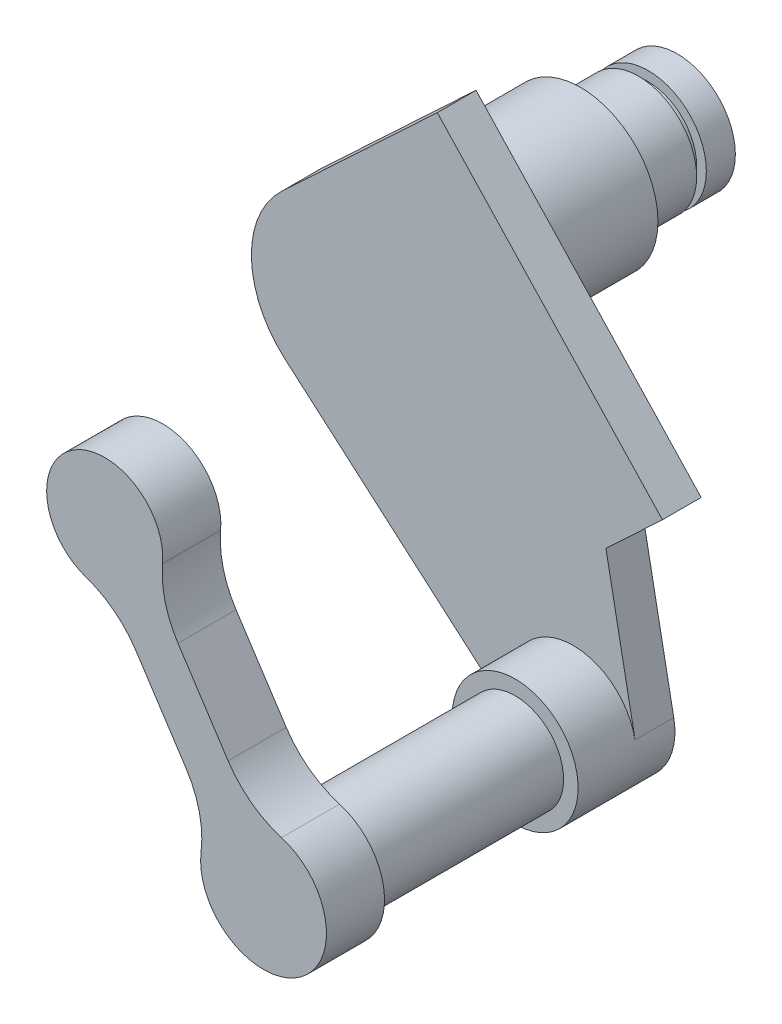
ISO-10303-21;
HEADER;
FILE_DESCRIPTION(('STEP AP214'),'2;1');
FILE_NAME('part.step','',(''),(''),'','','');
FILE_SCHEMA(('AUTOMOTIVE_DESIGN { 1 0 10303 214 1 1 1 1 }'));
ENDSEC;
DATA;
#1=APPLICATION_CONTEXT('core data for automotive mechanical design processes');
#2=APPLICATION_PROTOCOL_DEFINITION('international standard','automotive_design',2000,#1);
#3=PRODUCT_CONTEXT('',#1,'mechanical');
#4=PRODUCT('Part','Part','',(#3));
#5=PRODUCT_RELATED_PRODUCT_CATEGORY('part','',(#4));
#6=PRODUCT_DEFINITION_FORMATION('','',#4);
#7=PRODUCT_DEFINITION_CONTEXT('part definition',#1,'design');
#8=PRODUCT_DEFINITION('design','',#6,#7);
#9=PRODUCT_DEFINITION_SHAPE('','',#8);
#10=(LENGTH_UNIT() NAMED_UNIT(*) SI_UNIT(.MILLI.,.METRE.));
#11=(NAMED_UNIT(*) PLANE_ANGLE_UNIT() SI_UNIT($,.RADIAN.));
#12=(NAMED_UNIT(*) SI_UNIT($,.STERADIAN.) SOLID_ANGLE_UNIT());
#13=UNCERTAINTY_MEASURE_WITH_UNIT(LENGTH_MEASURE(1.E-05),#10,'distance_accuracy_value','');
#14=(GEOMETRIC_REPRESENTATION_CONTEXT(3) GLOBAL_UNCERTAINTY_ASSIGNED_CONTEXT((#13)) GLOBAL_UNIT_ASSIGNED_CONTEXT((#10,
#11,#12)) REPRESENTATION_CONTEXT('',''));
#15=CARTESIAN_POINT('',(0.,0.,0.));
#16=DIRECTION('',(0.,0.,1.));
#17=DIRECTION('',(1.,0.,0.));
#18=AXIS2_PLACEMENT_3D('',#15,#16,#17);
#19=CARTESIAN_POINT('',(-7.2469332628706,27.0459231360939,-15.));
#20=DIRECTION('',(0.,0.,-1.));
#21=DIRECTION('',(-1.,0.,0.));
#22=AXIS2_PLACEMENT_3D('',#19,#20,#21);
#23=PLANE('',#22);
#24=CARTESIAN_POINT('',(-7.2469332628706,27.0459231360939,-15.));
#25=DIRECTION('',(0.,0.,-1.));
#26=DIRECTION('',(-1.,0.,0.));
#27=AXIS2_PLACEMENT_3D('',#24,#25,#26);
#28=CIRCLE('',#27,3.25);
#29=CARTESIAN_POINT('',(-4.05542842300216,27.6597609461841,-15.));
#30=VERTEX_POINT('',#29);
#31=CARTESIAN_POINT('',(-9.37654934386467,24.5908802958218,-15.));
#32=VERTEX_POINT('',#31);
#33=EDGE_CURVE('E512',#30,#32,#28,.T.);
#34=ORIENTED_EDGE('',*,*,#33,.T.);
#35=DIRECTION('',(-0.755397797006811,0.655266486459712,0.));
#36=VECTOR('',#35,1.);
#37=CARTESIAN_POINT('',(-22.1500893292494,35.6712312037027,-15.));
#38=LINE('',#37,#36);
#39=CARTESIAN_POINT('',(-22.1500893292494,35.6712312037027,-15.));
#40=VERTEX_POINT('',#39);
#41=EDGE_CURVE('E515',#32,#40,#38,.T.);
#42=ORIENTED_EDGE('',*,*,#41,.T.);
#43=CARTESIAN_POINT('',(-18.8737568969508,39.4482201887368,-15.));
#44=DIRECTION('',(0.,0.,-1.));
#45=DIRECTION('',(-1.,0.,0.));
#46=AXIS2_PLACEMENT_3D('',#43,#44,#45);
#47=CIRCLE('',#46,5.);
#48=CARTESIAN_POINT('',(-22.2934109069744,43.0959546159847,-15.));
#49=VERTEX_POINT('',#48);
#50=EDGE_CURVE('E495',#40,#49,#47,.T.);
#51=ORIENTED_EDGE('',*,*,#50,.T.);
#52=DIRECTION('',(0.72954688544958,0.683930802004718,0.));
#53=VECTOR('',#52,1.);
#54=CARTESIAN_POINT('',(-14.268395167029,50.6191934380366,-15.));
#55=LINE('',#54,#53);
#56=CARTESIAN_POINT('',(-14.268395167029,50.6191934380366,-15.));
#57=VERTEX_POINT('',#56);
#58=EDGE_CURVE('E518',#49,#57,#55,.T.);
#59=ORIENTED_EDGE('',*,*,#58,.T.);
#60=DIRECTION('',(0.683930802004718,-0.72954688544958,0.));
#61=VECTOR('',#60,1.);
#62=CARTESIAN_POINT('',(-14.268395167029,50.6191934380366,-15.));
#63=LINE('',#62,#61);
#64=CARTESIAN_POINT('',(-2.64157153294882,38.2168963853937,-15.));
#65=VERTEX_POINT('',#64);
#66=EDGE_CURVE('E520',#57,#65,#63,.T.);
#67=ORIENTED_EDGE('',*,*,#66,.T.);
#68=DIRECTION('',(-0.729546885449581,-0.683930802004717,0.));
#69=VECTOR('',#68,1.);
#70=CARTESIAN_POINT('',(-2.64157153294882,38.2168963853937,-15.));
#71=LINE('',#70,#69);
#72=CARTESIAN_POINT('',(-5.55975907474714,35.4811731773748,-15.));
#73=VERTEX_POINT('',#72);
#74=EDGE_CURVE('E522',#65,#73,#71,.T.);
#75=ORIENTED_EDGE('',*,*,#74,.T.);
#76=DIRECTION('',(0.188873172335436,-0.982001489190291,0.));
#77=VECTOR('',#76,1.);
#78=CARTESIAN_POINT('',(-5.55975907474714,35.4811731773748,-15.));
#79=LINE('',#78,#77);
#80=EDGE_CURVE('E524',#73,#30,#79,.T.);
#81=ORIENTED_EDGE('',*,*,#80,.T.);
#82=EDGE_LOOP('',(#34,#42,#51,#59,#67,#75,#81));
#83=FACE_BOUND('',#82,.T.);
#84=CARTESIAN_POINT('',(-18.8737568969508,39.4482201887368,-15.));
#85=DIRECTION('',(0.,0.,1.));
#86=DIRECTION('',(1.,0.,0.));
#87=AXIS2_PLACEMENT_3D('',#84,#85,#86);
#88=CIRCLE('',#87,4.);
#89=CARTESIAN_POINT('',(-14.8737568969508,39.4482201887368,-15.));
#90=VERTEX_POINT('',#89);
#91=EDGE_CURVE('E637',#90,#90,#88,.T.);
#92=ORIENTED_EDGE('',*,*,#91,.T.);
#93=EDGE_LOOP('',(#92));
#94=FACE_BOUND('',#93,.T.);
#95=ADVANCED_FACE('F369',(#83,#94),#23,.T.);
#96=CARTESIAN_POINT('',(-7.47931043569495,38.9174814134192,0.));
#97=DIRECTION('',(0.,0.,-1.));
#98=DIRECTION('',(-1.,0.,0.));
#99=AXIS2_PLACEMENT_3D('',#96,#97,#98);
#100=PLANE('',#99);
#101=CARTESIAN_POINT('',(-7.47931043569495,38.9174814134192,0.));
#102=DIRECTION('',(0.,0.,-1.));
#103=DIRECTION('',(-1.,0.,0.));
#104=AXIS2_PLACEMENT_3D('',#101,#102,#103);
#105=CIRCLE('',#104,5.);
#106=CARTESIAN_POINT('',(-11.6654442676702,36.1832020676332,0.));
#107=VERTEX_POINT('',#106);
#108=CARTESIAN_POINT('',(-12.4608484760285,39.3467584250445,0.));
#109=VERTEX_POINT('',#108);
#110=EDGE_CURVE('E546',#107,#109,#105,.T.);
#111=ORIENTED_EDGE('',*,*,#110,.F.);
#112=DIRECTION('',(-0.5468558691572,0.837226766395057,0.));
#113=VECTOR('',#112,1.);
#114=CARTESIAN_POINT('',(-11.6654442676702,36.1832020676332,0.));
#115=LINE('',#114,#113);
#116=CARTESIAN_POINT('',(-9.07515286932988,32.2175112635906,0.));
#117=VERTEX_POINT('',#116);
#118=EDGE_CURVE('E561',#117,#107,#115,.T.);
#119=ORIENTED_EDGE('',*,*,#118,.F.);
#120=CARTESIAN_POINT('',(-4.88901903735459,34.9517906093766,0.));
#121=DIRECTION('',(0.,0.,-1.));
#122=DIRECTION('',(1.,0.,0.));
#123=AXIS2_PLACEMENT_3D('',#120,#121,#122);
#124=CIRCLE('',#123,5.);
#125=CARTESIAN_POINT('',(-6.31805796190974,30.160355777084,0.));
#126=VERTEX_POINT('',#125);
#127=EDGE_CURVE('E559',#126,#117,#124,.T.);
#128=ORIENTED_EDGE('',*,*,#127,.F.);
#129=CARTESIAN_POINT('',(-7.2469332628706,27.0459231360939,0.));
#130=DIRECTION('',(0.,0.,1.));
#131=DIRECTION('',(1.,0.,0.));
#132=AXIS2_PLACEMENT_3D('',#129,#130,#131);
#133=CIRCLE('',#132,3.25);
#134=CARTESIAN_POINT('',(-10.4720842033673,27.4470483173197,0.));
#135=VERTEX_POINT('',#134);
#136=EDGE_CURVE('E557',#135,#126,#133,.T.);
#137=ORIENTED_EDGE('',*,*,#136,.F.);
#138=CARTESIAN_POINT('',(-15.4338548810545,28.0641639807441,0.));
#139=DIRECTION('',(0.,0.,-1.));
#140=DIRECTION('',(1.,0.,0.));
#141=AXIS2_PLACEMENT_3D('',#138,#139,#140);
#142=CIRCLE('',#141,5.);
#143=CARTESIAN_POINT('',(-11.2477210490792,30.7984433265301,0.));
#144=VERTEX_POINT('',#143);
#145=EDGE_CURVE('E555',#144,#135,#142,.T.);
#146=ORIENTED_EDGE('',*,*,#145,.F.);
#147=DIRECTION('',(0.5468558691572,-0.837226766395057,0.));
#148=VECTOR('',#147,1.);
#149=CARTESIAN_POINT('',(-13.8380124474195,34.7641341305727,0.));
#150=LINE('',#149,#148);
#151=CARTESIAN_POINT('',(-13.8380124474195,34.7641341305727,0.));
#152=VERTEX_POINT('',#151);
#153=EDGE_CURVE('E553',#152,#144,#150,.T.);
#154=ORIENTED_EDGE('',*,*,#153,.F.);
#155=CARTESIAN_POINT('',(-18.0241462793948,32.0298547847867,0.));
#156=DIRECTION('',(0.,0.,-1.));
#157=DIRECTION('',(1.,0.,0.));
#158=AXIS2_PLACEMENT_3D('',#155,#156,#157);
#159=CIRCLE('',#158,5.);
#160=CARTESIAN_POINT('',(-16.4151619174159,36.7638984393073,0.));
#161=VERTEX_POINT('',#160);
#162=EDGE_CURVE('E551',#161,#152,#159,.T.);
#163=ORIENTED_EDGE('',*,*,#162,.F.);
#164=CARTESIAN_POINT('',(-15.4497713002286,39.6043246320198,0.));
#165=DIRECTION('',(0.,0.,1.));
#166=DIRECTION('',(1.,0.,0.));
#167=AXIS2_PLACEMENT_3D('',#164,#165,#166);
#168=CIRCLE('',#167,3.);
#169=EDGE_CURVE('E549',#109,#161,#168,.T.);
#170=ORIENTED_EDGE('',*,*,#169,.F.);
#171=EDGE_LOOP('',(#111,#119,#128,#137,#146,#154,#163,#170));
#172=FACE_BOUND('',#171,.T.);
#173=CARTESIAN_POINT('',(-7.2469332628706,27.0459231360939,0.));
#174=DIRECTION('',(0.,0.,-1.));
#175=DIRECTION('',(-1.,0.,0.));
#176=AXIS2_PLACEMENT_3D('',#173,#174,#175);
#177=CIRCLE('',#176,2.5);
#178=CARTESIAN_POINT('',(-4.7469332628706,27.0459231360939,0.));
#179=VERTEX_POINT('',#178);
#180=EDGE_CURVE('E540',#179,#179,#177,.T.);
#181=ORIENTED_EDGE('',*,*,#180,.F.);
#182=EDGE_LOOP('',(#181));
#183=FACE_BOUND('',#182,.T.);
#184=ADVANCED_FACE('F633',(#172,#183),#100,.T.);
#185=CARTESIAN_POINT('',(-7.47931043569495,38.9174814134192,3.));
#186=DIRECTION('',(0.,0.,-1.));
#187=DIRECTION('',(-1.,0.,0.));
#188=AXIS2_PLACEMENT_3D('',#185,#186,#187);
#189=CYLINDRICAL_SURFACE('',#188,5.);
#190=ORIENTED_EDGE('',*,*,#110,.T.);
#191=DIRECTION('',(0.,0.,-1.));
#192=VECTOR('',#191,1.);
#193=CARTESIAN_POINT('',(-12.4608484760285,39.3467584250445,3.));
#194=LINE('',#193,#192);
#195=CARTESIAN_POINT('',(-12.4608484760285,39.3467584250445,3.));
#196=VERTEX_POINT('',#195);
#197=EDGE_CURVE('E11',#196,#109,#194,.T.);
#198=ORIENTED_EDGE('',*,*,#197,.F.);
#199=CARTESIAN_POINT('',(-7.47931043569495,38.9174814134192,3.));
#200=DIRECTION('',(0.,0.,-1.));
#201=DIRECTION('',(-1.,0.,0.));
#202=AXIS2_PLACEMENT_3D('',#199,#200,#201);
#203=CIRCLE('',#202,5.);
#204=CARTESIAN_POINT('',(-11.6654442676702,36.1832020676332,3.));
#205=VERTEX_POINT('',#204);
#206=EDGE_CURVE('E563',#205,#196,#203,.T.);
#207=ORIENTED_EDGE('',*,*,#206,.F.);
#208=DIRECTION('',(0.,0.,-1.));
#209=VECTOR('',#208,1.);
#210=CARTESIAN_POINT('',(-11.6654442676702,36.1832020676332,3.));
#211=LINE('',#210,#209);
#212=EDGE_CURVE('E578',#205,#107,#211,.T.);
#213=ORIENTED_EDGE('',*,*,#212,.T.);
#214=EDGE_LOOP('',(#190,#198,#207,#213));
#215=FACE_BOUND('',#214,.T.);
#216=ADVANCED_FACE('F371',(#215),#189,.F.);
#217=CARTESIAN_POINT('',(-15.4497713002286,39.6043246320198,3.));
#218=DIRECTION('',(0.,0.,-1.));
#219=DIRECTION('',(-1.,0.,0.));
#220=AXIS2_PLACEMENT_3D('',#217,#218,#219);
#221=CYLINDRICAL_SURFACE('',#220,3.);
#222=ORIENTED_EDGE('',*,*,#169,.T.);
#223=DIRECTION('',(0.,0.,-1.));
#224=VECTOR('',#223,1.);
#225=CARTESIAN_POINT('',(-16.4151619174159,36.7638984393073,3.));
#226=LINE('',#225,#224);
#227=CARTESIAN_POINT('',(-16.4151619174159,36.7638984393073,3.));
#228=VERTEX_POINT('',#227);
#229=EDGE_CURVE('E378',#228,#161,#226,.T.);
#230=ORIENTED_EDGE('',*,*,#229,.F.);
#231=CARTESIAN_POINT('',(-15.4497713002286,39.6043246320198,3.));
#232=DIRECTION('',(0.,0.,1.));
#233=DIRECTION('',(1.,0.,0.));
#234=AXIS2_PLACEMENT_3D('',#231,#232,#233);
#235=CIRCLE('',#234,3.);
#236=EDGE_CURVE('E565',#196,#228,#235,.T.);
#237=ORIENTED_EDGE('',*,*,#236,.F.);
#238=ORIENTED_EDGE('',*,*,#197,.T.);
#239=EDGE_LOOP('',(#222,#230,#237,#238));
#240=FACE_BOUND('',#239,.T.);
#241=ADVANCED_FACE('F727',(#240),#221,.T.);
#242=CARTESIAN_POINT('',(-18.0241462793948,32.0298547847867,3.));
#243=DIRECTION('',(0.,0.,-1.));
#244=DIRECTION('',(-1.,0.,0.));
#245=AXIS2_PLACEMENT_3D('',#242,#243,#244);
#246=CYLINDRICAL_SURFACE('',#245,5.);
#247=ORIENTED_EDGE('',*,*,#162,.T.);
#248=DIRECTION('',(0.,0.,-1.));
#249=VECTOR('',#248,1.);
#250=CARTESIAN_POINT('',(-13.8380124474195,34.7641341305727,3.));
#251=LINE('',#250,#249);
#252=CARTESIAN_POINT('',(-13.8380124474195,34.7641341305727,3.));
#253=VERTEX_POINT('',#252);
#254=EDGE_CURVE('E593',#253,#152,#251,.T.);
#255=ORIENTED_EDGE('',*,*,#254,.F.);
#256=CARTESIAN_POINT('',(-18.0241462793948,32.0298547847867,3.));
#257=DIRECTION('',(0.,0.,-1.));
#258=DIRECTION('',(1.,0.,0.));
#259=AXIS2_PLACEMENT_3D('',#256,#257,#258);
#260=CIRCLE('',#259,5.);
#261=EDGE_CURVE('E567',#228,#253,#260,.T.);
#262=ORIENTED_EDGE('',*,*,#261,.F.);
#263=ORIENTED_EDGE('',*,*,#229,.T.);
#264=EDGE_LOOP('',(#247,#255,#262,#263));
#265=FACE_BOUND('',#264,.T.);
#266=ADVANCED_FACE('F724',(#265),#246,.F.);
#267=CARTESIAN_POINT('',(-13.8380124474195,34.7641341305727,3.));
#268=DIRECTION('',(0.837226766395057,0.5468558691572,0.));
#269=DIRECTION('',(-0.546855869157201,0.837226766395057,0.));
#270=AXIS2_PLACEMENT_3D('',#267,#268,#269);
#271=PLANE('',#270);
#272=ORIENTED_EDGE('',*,*,#153,.T.);
#273=DIRECTION('',(0.,0.,-1.));
#274=VECTOR('',#273,1.);
#275=CARTESIAN_POINT('',(-11.2477210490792,30.7984433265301,3.));
#276=LINE('',#275,#274);
#277=CARTESIAN_POINT('',(-11.2477210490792,30.7984433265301,3.));
#278=VERTEX_POINT('',#277);
#279=EDGE_CURVE('E590',#278,#144,#276,.T.);
#280=ORIENTED_EDGE('',*,*,#279,.F.);
#281=DIRECTION('',(0.5468558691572,-0.837226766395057,0.));
#282=VECTOR('',#281,1.);
#283=CARTESIAN_POINT('',(-13.8380124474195,34.7641341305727,3.));
#284=LINE('',#283,#282);
#285=EDGE_CURVE('E569',#253,#278,#284,.T.);
#286=ORIENTED_EDGE('',*,*,#285,.F.);
#287=ORIENTED_EDGE('',*,*,#254,.T.);
#288=EDGE_LOOP('',(#272,#280,#286,#287));
#289=FACE_BOUND('',#288,.T.);
#290=ADVANCED_FACE('F720',(#289),#271,.F.);
#291=CARTESIAN_POINT('',(-15.4338548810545,28.0641639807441,3.));
#292=DIRECTION('',(0.,0.,-1.));
#293=DIRECTION('',(-1.,0.,0.));
#294=AXIS2_PLACEMENT_3D('',#291,#292,#293);
#295=CYLINDRICAL_SURFACE('',#294,5.);
#296=ORIENTED_EDGE('',*,*,#145,.T.);
#297=DIRECTION('',(0.,0.,-1.));
#298=VECTOR('',#297,1.);
#299=CARTESIAN_POINT('',(-10.4720842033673,27.4470483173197,3.));
#300=LINE('',#299,#298);
#301=CARTESIAN_POINT('',(-10.4720842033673,27.4470483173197,3.));
#302=VERTEX_POINT('',#301);
#303=EDGE_CURVE('E587',#302,#135,#300,.T.);
#304=ORIENTED_EDGE('',*,*,#303,.F.);
#305=CARTESIAN_POINT('',(-15.4338548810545,28.0641639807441,3.));
#306=DIRECTION('',(0.,0.,-1.));
#307=DIRECTION('',(1.,0.,0.));
#308=AXIS2_PLACEMENT_3D('',#305,#306,#307);
#309=CIRCLE('',#308,5.);
#310=EDGE_CURVE('E571',#278,#302,#309,.T.);
#311=ORIENTED_EDGE('',*,*,#310,.F.);
#312=ORIENTED_EDGE('',*,*,#279,.T.);
#313=EDGE_LOOP('',(#296,#304,#311,#312));
#314=FACE_BOUND('',#313,.T.);
#315=ADVANCED_FACE('F716',(#314),#295,.F.);
#316=CARTESIAN_POINT('',(-7.2469332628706,27.0459231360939,3.));
#317=DIRECTION('',(0.,0.,-1.));
#318=DIRECTION('',(-1.,0.,0.));
#319=AXIS2_PLACEMENT_3D('',#316,#317,#318);
#320=CYLINDRICAL_SURFACE('',#319,3.25);
#321=ORIENTED_EDGE('',*,*,#136,.T.);
#322=DIRECTION('',(0.,0.,-1.));
#323=VECTOR('',#322,1.);
#324=CARTESIAN_POINT('',(-6.31805796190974,30.160355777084,3.));
#325=LINE('',#324,#323);
#326=CARTESIAN_POINT('',(-6.31805796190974,30.160355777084,3.));
#327=VERTEX_POINT('',#326);
#328=EDGE_CURVE('E584',#327,#126,#325,.T.);
#329=ORIENTED_EDGE('',*,*,#328,.F.);
#330=CARTESIAN_POINT('',(-7.2469332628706,27.0459231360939,3.));
#331=DIRECTION('',(0.,0.,1.));
#332=DIRECTION('',(1.,0.,0.));
#333=AXIS2_PLACEMENT_3D('',#330,#331,#332);
#334=CIRCLE('',#333,3.25);
#335=EDGE_CURVE('E573',#302,#327,#334,.T.);
#336=ORIENTED_EDGE('',*,*,#335,.F.);
#337=ORIENTED_EDGE('',*,*,#303,.T.);
#338=EDGE_LOOP('',(#321,#329,#336,#337));
#339=FACE_BOUND('',#338,.T.);
#340=ADVANCED_FACE('F712',(#339),#320,.T.);
#341=CARTESIAN_POINT('',(-4.88901903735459,34.9517906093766,3.));
#342=DIRECTION('',(0.,0.,-1.));
#343=DIRECTION('',(-1.,0.,0.));
#344=AXIS2_PLACEMENT_3D('',#341,#342,#343);
#345=CYLINDRICAL_SURFACE('',#344,5.);
#346=ORIENTED_EDGE('',*,*,#127,.T.);
#347=DIRECTION('',(0.,0.,-1.));
#348=VECTOR('',#347,1.);
#349=CARTESIAN_POINT('',(-9.07515286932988,32.2175112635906,3.));
#350=LINE('',#349,#348);
#351=CARTESIAN_POINT('',(-9.07515286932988,32.2175112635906,3.));
#352=VERTEX_POINT('',#351);
#353=EDGE_CURVE('E581',#352,#117,#350,.T.);
#354=ORIENTED_EDGE('',*,*,#353,.F.);
#355=CARTESIAN_POINT('',(-4.88901903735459,34.9517906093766,3.));
#356=DIRECTION('',(0.,0.,-1.));
#357=DIRECTION('',(1.,0.,0.));
#358=AXIS2_PLACEMENT_3D('',#355,#356,#357);
#359=CIRCLE('',#358,5.);
#360=EDGE_CURVE('E575',#327,#352,#359,.T.);
#361=ORIENTED_EDGE('',*,*,#360,.F.);
#362=ORIENTED_EDGE('',*,*,#328,.T.);
#363=EDGE_LOOP('',(#346,#354,#361,#362));
#364=FACE_BOUND('',#363,.T.);
#365=ADVANCED_FACE('F708',(#364),#345,.F.);
#366=CARTESIAN_POINT('',(-11.6654442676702,36.1832020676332,3.));
#367=DIRECTION('',(-0.837226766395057,-0.5468558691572,0.));
#368=DIRECTION('',(0.5468558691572,-0.837226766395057,0.));
#369=AXIS2_PLACEMENT_3D('',#366,#367,#368);
#370=PLANE('',#369);
#371=ORIENTED_EDGE('',*,*,#118,.T.);
#372=ORIENTED_EDGE('',*,*,#212,.F.);
#373=DIRECTION('',(-0.5468558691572,0.837226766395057,0.));
#374=VECTOR('',#373,1.);
#375=CARTESIAN_POINT('',(-11.6654442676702,36.1832020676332,3.));
#376=LINE('',#375,#374);
#377=EDGE_CURVE('E394',#352,#205,#376,.T.);
#378=ORIENTED_EDGE('',*,*,#377,.F.);
#379=ORIENTED_EDGE('',*,*,#353,.T.);
#380=EDGE_LOOP('',(#371,#372,#378,#379));
#381=FACE_BOUND('',#380,.T.);
#382=ADVANCED_FACE('F705',(#381),#370,.F.);
#383=CARTESIAN_POINT('',(-7.47931043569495,38.9174814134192,3.));
#384=DIRECTION('',(0.,0.,-1.));
#385=DIRECTION('',(-1.,0.,0.));
#386=AXIS2_PLACEMENT_3D('',#383,#384,#385);
#387=PLANE('',#386);
#388=ORIENTED_EDGE('',*,*,#206,.T.);
#389=ORIENTED_EDGE('',*,*,#236,.T.);
#390=ORIENTED_EDGE('',*,*,#261,.T.);
#391=ORIENTED_EDGE('',*,*,#285,.T.);
#392=ORIENTED_EDGE('',*,*,#310,.T.);
#393=ORIENTED_EDGE('',*,*,#335,.T.);
#394=ORIENTED_EDGE('',*,*,#360,.T.);
#395=ORIENTED_EDGE('',*,*,#377,.T.);
#396=EDGE_LOOP('',(#388,#389,#390,#391,#392,#393,#394,#395));
#397=FACE_BOUND('',#396,.T.);
#398=ADVANCED_FACE('F698',(#397),#387,.F.);
#399=CARTESIAN_POINT('',(-7.2469332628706,27.0459231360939,-17.0710678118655));
#400=DIRECTION('',(0.,0.,1.));
#401=DIRECTION('',(1.,0.,0.));
#402=AXIS2_PLACEMENT_3D('',#399,#400,#401);
#403=CYLINDRICAL_SURFACE('',#402,2.5);
#404=CARTESIAN_POINT('',(-7.2469332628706,27.0459231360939,-10.));
#405=DIRECTION('',(0.,0.,-1.));
#406=DIRECTION('',(-1.,0.,0.));
#407=AXIS2_PLACEMENT_3D('',#404,#405,#406);
#408=CIRCLE('',#407,2.5);
#409=CARTESIAN_POINT('',(-4.7469332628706,27.0459231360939,-10.));
#410=VERTEX_POINT('',#409);
#411=EDGE_CURVE('E543',#410,#410,#408,.T.);
#412=CARTESIAN_POINT('',(-4.7469332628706,27.0459231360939,0.));
#413=CARTESIAN_POINT('',(-4.7469332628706,27.0459231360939,-0.104166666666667));
#414=CARTESIAN_POINT('',(-4.7469332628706,27.0459231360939,-0.208333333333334));
#415=CARTESIAN_POINT('',(-4.7469332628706,27.0459231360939,-0.416666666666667));
#416=CARTESIAN_POINT('',(-4.7469332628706,27.0459231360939,-0.520833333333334));
#417=CARTESIAN_POINT('',(-4.7469332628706,27.0459231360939,-0.729166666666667));
#418=CARTESIAN_POINT('',(-4.7469332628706,27.0459231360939,-0.833333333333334));
#419=CARTESIAN_POINT('',(-4.7469332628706,27.0459231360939,-1.04166666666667));
#420=CARTESIAN_POINT('',(-4.7469332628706,27.0459231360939,-1.14583333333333));
#421=CARTESIAN_POINT('',(-4.7469332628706,27.0459231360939,-1.35416666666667));
#422=CARTESIAN_POINT('',(-4.7469332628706,27.0459231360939,-1.45833333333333));
#423=CARTESIAN_POINT('',(-4.7469332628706,27.0459231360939,-1.66666666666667));
#424=CARTESIAN_POINT('',(-4.7469332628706,27.0459231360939,-1.77083333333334));
#425=CARTESIAN_POINT('',(-4.7469332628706,27.0459231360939,-1.97916666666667));
#426=CARTESIAN_POINT('',(-4.7469332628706,27.0459231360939,-2.08333333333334));
#427=CARTESIAN_POINT('',(-4.7469332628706,27.0459231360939,-2.29166666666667));
#428=CARTESIAN_POINT('',(-4.7469332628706,27.0459231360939,-2.39583333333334));
#429=CARTESIAN_POINT('',(-4.7469332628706,27.0459231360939,-2.60416666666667));
#430=CARTESIAN_POINT('',(-4.7469332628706,27.0459231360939,-2.70833333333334));
#431=CARTESIAN_POINT('',(-4.7469332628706,27.0459231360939,-2.91666666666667));
#432=CARTESIAN_POINT('',(-4.7469332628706,27.0459231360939,-3.02083333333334));
#433=CARTESIAN_POINT('',(-4.7469332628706,27.0459231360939,-3.22916666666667));
#434=CARTESIAN_POINT('',(-4.7469332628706,27.0459231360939,-3.33333333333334));
#435=CARTESIAN_POINT('',(-4.7469332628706,27.0459231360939,-3.54166666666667));
#436=CARTESIAN_POINT('',(-4.7469332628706,27.0459231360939,-3.64583333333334));
#437=CARTESIAN_POINT('',(-4.7469332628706,27.0459231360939,-3.85416666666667));
#438=CARTESIAN_POINT('',(-4.7469332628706,27.0459231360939,-3.95833333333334));
#439=CARTESIAN_POINT('',(-4.7469332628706,27.0459231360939,-4.16666666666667));
#440=CARTESIAN_POINT('',(-4.7469332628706,27.0459231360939,-4.27083333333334));
#441=CARTESIAN_POINT('',(-4.7469332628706,27.0459231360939,-4.47916666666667));
#442=CARTESIAN_POINT('',(-4.7469332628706,27.0459231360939,-4.58333333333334));
#443=CARTESIAN_POINT('',(-4.7469332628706,27.0459231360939,-4.79166666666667));
#444=CARTESIAN_POINT('',(-4.7469332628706,27.0459231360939,-4.89583333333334));
#445=CARTESIAN_POINT('',(-4.7469332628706,27.0459231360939,-5.10416666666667));
#446=CARTESIAN_POINT('',(-4.7469332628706,27.0459231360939,-5.20833333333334));
#447=CARTESIAN_POINT('',(-4.7469332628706,27.0459231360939,-5.41666666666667));
#448=CARTESIAN_POINT('',(-4.7469332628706,27.0459231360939,-5.52083333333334));
#449=CARTESIAN_POINT('',(-4.7469332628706,27.0459231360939,-5.72916666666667));
#450=CARTESIAN_POINT('',(-4.7469332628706,27.0459231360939,-5.83333333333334));
#451=CARTESIAN_POINT('',(-4.7469332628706,27.0459231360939,-6.04166666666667));
#452=CARTESIAN_POINT('',(-4.7469332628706,27.0459231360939,-6.14583333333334));
#453=CARTESIAN_POINT('',(-4.7469332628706,27.0459231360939,-6.35416666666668));
#454=CARTESIAN_POINT('',(-4.7469332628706,27.0459231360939,-6.45833333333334));
#455=CARTESIAN_POINT('',(-4.7469332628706,27.0459231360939,-6.66666666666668));
#456=CARTESIAN_POINT('',(-4.7469332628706,27.0459231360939,-6.77083333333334));
#457=CARTESIAN_POINT('',(-4.7469332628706,27.0459231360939,-6.97916666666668));
#458=CARTESIAN_POINT('',(-4.7469332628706,27.0459231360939,-7.08333333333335));
#459=CARTESIAN_POINT('',(-4.7469332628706,27.0459231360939,-7.29166666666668));
#460=CARTESIAN_POINT('',(-4.7469332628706,27.0459231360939,-7.39583333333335));
#461=CARTESIAN_POINT('',(-4.7469332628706,27.0459231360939,-7.60416666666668));
#462=CARTESIAN_POINT('',(-4.7469332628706,27.0459231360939,-7.70833333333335));
#463=CARTESIAN_POINT('',(-4.7469332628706,27.0459231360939,-7.91666666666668));
#464=CARTESIAN_POINT('',(-4.7469332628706,27.0459231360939,-8.02083333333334));
#465=CARTESIAN_POINT('',(-4.7469332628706,27.0459231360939,-8.22916666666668));
#466=CARTESIAN_POINT('',(-4.7469332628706,27.0459231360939,-8.33333333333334));
#467=CARTESIAN_POINT('',(-4.7469332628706,27.0459231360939,-8.54166666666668));
#468=CARTESIAN_POINT('',(-4.7469332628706,27.0459231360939,-8.64583333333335));
#469=CARTESIAN_POINT('',(-4.7469332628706,27.0459231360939,-8.85416666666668));
#470=CARTESIAN_POINT('',(-4.7469332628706,27.0459231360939,-8.95833333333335));
#471=CARTESIAN_POINT('',(-4.7469332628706,27.0459231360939,-9.16666666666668));
#472=CARTESIAN_POINT('',(-4.7469332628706,27.0459231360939,-9.27083333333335));
#473=CARTESIAN_POINT('',(-4.7469332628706,27.0459231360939,-9.47916666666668));
#474=CARTESIAN_POINT('',(-4.7469332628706,27.0459231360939,-9.58333333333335));
#475=CARTESIAN_POINT('',(-4.7469332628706,27.0459231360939,-9.79166666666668));
#476=CARTESIAN_POINT('',(-4.7469332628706,27.0459231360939,-9.89583333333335));
#477=CARTESIAN_POINT('',(-4.7469332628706,27.0459231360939,-10.));
#478=B_SPLINE_CURVE_WITH_KNOTS('',3,(#412,#413,#414,#415,#416,#417,#418,#419,#420,#421,#422,
#423,#424,#425,#426,#427,#428,#429,#430,#431,#432,#433,#434,#435,#436,#437,#438,#439,#440,#441,
#442,#443,#444,#445,#446,#447,#448,#449,#450,#451,#452,#453,#454,#455,#456,#457,#458,#459,#460,
#461,#462,#463,#464,#465,#466,#467,#468,#469,#470,#471,#472,#473,#474,#475,#476,#477),
.UNSPECIFIED.,.F.,.F.,(4,2,2,2,2,2,2,2,2,2,2,2,2,2,2,2,2,2,2,2,2,2,2,2,2,2,2,2,2,2,2,2,4),(0.,
0.3125,0.625000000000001,0.937500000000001,1.25,1.5625,1.875,2.1875,2.5,2.8125,3.125,3.4375,
3.75,4.06250000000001,4.37500000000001,4.68750000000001,5.00000000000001,5.31250000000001,
5.62500000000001,5.93750000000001,6.25000000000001,6.56250000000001,6.87500000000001,
7.18750000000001,7.50000000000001,7.81250000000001,8.12500000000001,8.43750000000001,
8.75000000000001,9.06250000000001,9.37500000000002,9.68750000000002,10.),.UNSPECIFIED.);
#479=EDGE_CURVE('BSEAM692',#179,#410,#478,.T.);
#480=ORIENTED_EDGE('',*,*,#180,.T.);
#481=ORIENTED_EDGE('',*,*,#411,.F.);
#482=ORIENTED_EDGE('',*,*,#479,.T.);
#483=ORIENTED_EDGE('',*,*,#479,.F.);
#484=EDGE_LOOP('',(#480,#482,#481,#483));
#485=FACE_BOUND('',#484,.T.);
#486=ADVANCED_FACE('F692',(#485),#403,.T.);
#487=CARTESIAN_POINT('',(-7.2469332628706,27.0459231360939,-10.));
#488=DIRECTION('',(0.,0.,-1.));
#489=DIRECTION('',(-1.,0.,0.));
#490=AXIS2_PLACEMENT_3D('',#487,#488,#489);
#491=PLANE('',#490);
#492=CARTESIAN_POINT('',(-7.2469332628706,27.0459231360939,-10.));
#493=DIRECTION('',(0.,0.,-1.));
#494=DIRECTION('',(-1.,0.,0.));
#495=AXIS2_PLACEMENT_3D('',#492,#493,#494);
#496=CIRCLE('',#495,3.25);
#497=CARTESIAN_POINT('',(-10.4969332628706,27.0459231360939,-10.));
#498=VERTEX_POINT('',#497);
#499=EDGE_CURVE('E537',#498,#498,#496,.T.);
#500=ORIENTED_EDGE('',*,*,#499,.F.);
#501=EDGE_LOOP('',(#500));
#502=FACE_BOUND('',#501,.T.);
#503=ORIENTED_EDGE('',*,*,#411,.T.);
#504=EDGE_LOOP('',(#503));
#505=FACE_BOUND('',#504,.T.);
#506=ADVANCED_FACE('F689',(#502,#505),#491,.F.);
#507=CARTESIAN_POINT('',(-7.2469332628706,27.0459231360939,-13.));
#508=DIRECTION('',(0.,0.,1.));
#509=DIRECTION('',(1.,0.,0.));
#510=AXIS2_PLACEMENT_3D('',#507,#508,#509);
#511=CYLINDRICAL_SURFACE('',#510,3.25);
#512=CARTESIAN_POINT('',(-7.2469332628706,27.0459231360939,-13.));
#513=DIRECTION('',(0.,0.,-1.));
#514=DIRECTION('',(-1.,0.,0.));
#515=AXIS2_PLACEMENT_3D('',#512,#513,#514);
#516=CIRCLE('',#515,3.25);
#517=CARTESIAN_POINT('',(-9.37654934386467,24.5908802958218,-13.));
#518=VERTEX_POINT('',#517);
#519=CARTESIAN_POINT('',(-4.05542842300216,27.6597609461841,-13.));
#520=VERTEX_POINT('',#519);
#521=EDGE_CURVE('E386',#518,#520,#516,.T.);
#522=ORIENTED_EDGE('',*,*,#521,.F.);
#523=DIRECTION('',(0.,0.,1.));
#524=VECTOR('',#523,1.);
#525=CARTESIAN_POINT('',(-9.37654934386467,24.5908802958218,-15.));
#526=LINE('',#525,#524);
#527=EDGE_CURVE('E485',#32,#518,#526,.T.);
#528=ORIENTED_EDGE('',*,*,#527,.F.);
#529=ORIENTED_EDGE('',*,*,#33,.F.);
#530=DIRECTION('',(0.,0.,1.));
#531=VECTOR('',#530,1.);
#532=CARTESIAN_POINT('',(-4.05542842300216,27.6597609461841,-15.));
#533=LINE('',#532,#531);
#534=EDGE_CURVE('E526',#30,#520,#533,.T.);
#535=ORIENTED_EDGE('',*,*,#534,.T.);
#536=EDGE_LOOP('',(#522,#528,#529,#535));
#537=FACE_BOUND('',#536,.T.);
#538=ORIENTED_EDGE('',*,*,#499,.T.);
#539=EDGE_LOOP('',(#538));
#540=FACE_BOUND('',#539,.T.);
#541=ADVANCED_FACE('F611',(#537,#540),#511,.T.);
#542=CARTESIAN_POINT('',(-7.2469332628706,27.0459231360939,-13.));
#543=DIRECTION('',(0.,0.,-1.));
#544=DIRECTION('',(-1.,0.,0.));
#545=AXIS2_PLACEMENT_3D('',#542,#543,#544);
#546=PLANE('',#545);
#547=DIRECTION('',(-0.755397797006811,0.655266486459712,0.));
#548=VECTOR('',#547,1.);
#549=CARTESIAN_POINT('',(-22.1500893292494,35.6712312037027,-13.));
#550=LINE('',#549,#548);
#551=CARTESIAN_POINT('',(-22.1500893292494,35.6712312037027,-13.));
#552=VERTEX_POINT('',#551);
#553=EDGE_CURVE('E480',#518,#552,#550,.T.);
#554=ORIENTED_EDGE('',*,*,#553,.F.);
#555=ORIENTED_EDGE('',*,*,#521,.T.);
#556=DIRECTION('',(0.188873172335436,-0.982001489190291,0.));
#557=VECTOR('',#556,1.);
#558=CARTESIAN_POINT('',(-5.55975907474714,35.4811731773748,-13.));
#559=LINE('',#558,#557);
#560=CARTESIAN_POINT('',(-5.55975907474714,35.4811731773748,-13.));
#561=VERTEX_POINT('',#560);
#562=EDGE_CURVE('E511',#561,#520,#559,.T.);
#563=ORIENTED_EDGE('',*,*,#562,.F.);
#564=DIRECTION('',(-0.729546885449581,-0.683930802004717,0.));
#565=VECTOR('',#564,1.);
#566=CARTESIAN_POINT('',(-2.64157153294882,38.2168963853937,-13.));
#567=LINE('',#566,#565);
#568=CARTESIAN_POINT('',(-2.64157153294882,38.2168963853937,-13.));
#569=VERTEX_POINT('',#568);
#570=EDGE_CURVE('E509',#569,#561,#567,.T.);
#571=ORIENTED_EDGE('',*,*,#570,.F.);
#572=DIRECTION('',(0.683930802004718,-0.72954688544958,0.));
#573=VECTOR('',#572,1.);
#574=CARTESIAN_POINT('',(-14.268395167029,50.6191934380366,-13.));
#575=LINE('',#574,#573);
#576=CARTESIAN_POINT('',(-14.268395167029,50.6191934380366,-13.));
#577=VERTEX_POINT('',#576);
#578=EDGE_CURVE('E503',#577,#569,#575,.T.);
#579=ORIENTED_EDGE('',*,*,#578,.F.);
#580=DIRECTION('',(0.72954688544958,0.683930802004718,0.));
#581=VECTOR('',#580,1.);
#582=CARTESIAN_POINT('',(-14.268395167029,50.6191934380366,-13.));
#583=LINE('',#582,#581);
#584=CARTESIAN_POINT('',(-22.2934109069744,43.0959546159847,-13.));
#585=VERTEX_POINT('',#584);
#586=EDGE_CURVE('E501',#585,#577,#583,.T.);
#587=ORIENTED_EDGE('',*,*,#586,.F.);
#588=CARTESIAN_POINT('',(-18.8737568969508,39.4482201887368,-13.));
#589=DIRECTION('',(0.,0.,-1.));
#590=DIRECTION('',(-1.,0.,0.));
#591=AXIS2_PLACEMENT_3D('',#588,#589,#590);
#592=CIRCLE('',#591,5.);
#593=EDGE_CURVE('E488',#552,#585,#592,.T.);
#594=ORIENTED_EDGE('',*,*,#593,.F.);
#595=EDGE_LOOP('',(#554,#555,#563,#571,#579,#587,#594));
#596=FACE_BOUND('',#595,.T.);
#597=ADVANCED_FACE('F499',(#596),#546,.F.);
#598=CARTESIAN_POINT('',(-22.1500893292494,35.6712312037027,-15.));
#599=DIRECTION('',(0.655266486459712,0.755397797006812,0.));
#600=DIRECTION('',(-0.755397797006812,0.655266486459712,0.));
#601=AXIS2_PLACEMENT_3D('',#598,#599,#600);
#602=PLANE('',#601);
#603=ORIENTED_EDGE('',*,*,#553,.T.);
#604=DIRECTION('',(0.,0.,1.));
#605=VECTOR('',#604,1.);
#606=CARTESIAN_POINT('',(-22.1500893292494,35.6712312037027,-15.));
#607=LINE('',#606,#605);
#608=EDGE_CURVE('E483',#40,#552,#607,.T.);
#609=ORIENTED_EDGE('',*,*,#608,.F.);
#610=ORIENTED_EDGE('',*,*,#41,.F.);
#611=ORIENTED_EDGE('',*,*,#527,.T.);
#612=EDGE_LOOP('',(#603,#609,#610,#611));
#613=FACE_BOUND('',#612,.T.);
#614=ADVANCED_FACE('F482',(#613),#602,.F.);
#615=CARTESIAN_POINT('',(-18.8737568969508,39.4482201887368,-15.));
#616=DIRECTION('',(0.,0.,1.));
#617=DIRECTION('',(1.,0.,0.));
#618=AXIS2_PLACEMENT_3D('',#615,#616,#617);
#619=CYLINDRICAL_SURFACE('',#618,5.);
#620=ORIENTED_EDGE('',*,*,#593,.T.);
#621=DIRECTION('',(0.,0.,1.));
#622=VECTOR('',#621,1.);
#623=CARTESIAN_POINT('',(-22.2934109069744,43.0959546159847,-15.));
#624=LINE('',#623,#622);
#625=EDGE_CURVE('E496',#49,#585,#624,.T.);
#626=ORIENTED_EDGE('',*,*,#625,.F.);
#627=ORIENTED_EDGE('',*,*,#50,.F.);
#628=ORIENTED_EDGE('',*,*,#608,.T.);
#629=EDGE_LOOP('',(#620,#626,#627,#628));
#630=FACE_BOUND('',#629,.T.);
#631=ADVANCED_FACE('F492',(#630),#619,.T.);
#632=CARTESIAN_POINT('',(-14.268395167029,50.6191934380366,-15.));
#633=DIRECTION('',(0.683930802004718,-0.72954688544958,0.));
#634=DIRECTION('',(0.72954688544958,0.683930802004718,0.));
#635=AXIS2_PLACEMENT_3D('',#632,#633,#634);
#636=PLANE('',#635);
#637=ORIENTED_EDGE('',*,*,#586,.T.);
#638=DIRECTION('',(0.,0.,1.));
#639=VECTOR('',#638,1.);
#640=CARTESIAN_POINT('',(-14.268395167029,50.6191934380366,-15.));
#641=LINE('',#640,#639);
#642=EDGE_CURVE('E533',#57,#577,#641,.T.);
#643=ORIENTED_EDGE('',*,*,#642,.F.);
#644=ORIENTED_EDGE('',*,*,#58,.F.);
#645=ORIENTED_EDGE('',*,*,#625,.T.);
#646=EDGE_LOOP('',(#637,#643,#644,#645));
#647=FACE_BOUND('',#646,.T.);
#648=ADVANCED_FACE('F629',(#647),#636,.F.);
#649=CARTESIAN_POINT('',(-14.268395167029,50.6191934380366,-15.));
#650=DIRECTION('',(-0.72954688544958,-0.683930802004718,0.));
#651=DIRECTION('',(0.683930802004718,-0.72954688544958,0.));
#652=AXIS2_PLACEMENT_3D('',#649,#650,#651);
#653=PLANE('',#652);
#654=ORIENTED_EDGE('',*,*,#578,.T.);
#655=DIRECTION('',(0.,0.,1.));
#656=VECTOR('',#655,1.);
#657=CARTESIAN_POINT('',(-2.64157153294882,38.2168963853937,-15.));
#658=LINE('',#657,#656);
#659=EDGE_CURVE('E530',#65,#569,#658,.T.);
#660=ORIENTED_EDGE('',*,*,#659,.F.);
#661=ORIENTED_EDGE('',*,*,#66,.F.);
#662=ORIENTED_EDGE('',*,*,#642,.T.);
#663=EDGE_LOOP('',(#654,#660,#661,#662));
#664=FACE_BOUND('',#663,.T.);
#665=ADVANCED_FACE('F625',(#664),#653,.F.);
#666=CARTESIAN_POINT('',(-2.64157153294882,38.2168963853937,-15.));
#667=DIRECTION('',(-0.683930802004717,0.729546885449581,0.));
#668=DIRECTION('',(-0.729546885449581,-0.683930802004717,0.));
#669=AXIS2_PLACEMENT_3D('',#666,#667,#668);
#670=PLANE('',#669);
#671=ORIENTED_EDGE('',*,*,#570,.T.);
#672=DIRECTION('',(0.,0.,1.));
#673=VECTOR('',#672,1.);
#674=CARTESIAN_POINT('',(-5.55975907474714,35.4811731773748,-15.));
#675=LINE('',#674,#673);
#676=EDGE_CURVE('E527',#73,#561,#675,.T.);
#677=ORIENTED_EDGE('',*,*,#676,.F.);
#678=ORIENTED_EDGE('',*,*,#74,.F.);
#679=ORIENTED_EDGE('',*,*,#659,.T.);
#680=EDGE_LOOP('',(#671,#677,#678,#679));
#681=FACE_BOUND('',#680,.T.);
#682=ADVANCED_FACE('F620',(#681),#670,.F.);
#683=CARTESIAN_POINT('',(-5.55975907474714,35.4811731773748,-15.));
#684=DIRECTION('',(-0.982001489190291,-0.188873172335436,0.));
#685=DIRECTION('',(0.188873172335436,-0.982001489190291,0.));
#686=AXIS2_PLACEMENT_3D('',#683,#684,#685);
#687=PLANE('',#686);
#688=ORIENTED_EDGE('',*,*,#562,.T.);
#689=ORIENTED_EDGE('',*,*,#534,.F.);
#690=ORIENTED_EDGE('',*,*,#80,.F.);
#691=ORIENTED_EDGE('',*,*,#676,.T.);
#692=EDGE_LOOP('',(#688,#689,#690,#691));
#693=FACE_BOUND('',#692,.T.);
#694=ADVANCED_FACE('F615',(#693),#687,.F.);
#695=CARTESIAN_POINT('',(-21.8737568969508,39.4482201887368,-30.));
#696=DIRECTION('',(0.,0.,1.));
#697=DIRECTION('',(1.,0.,0.));
#698=AXIS2_PLACEMENT_3D('',#695,#696,#697);
#699=PLANE('',#698);
#700=CARTESIAN_POINT('',(-18.8737568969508,39.4482201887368,-30.));
#701=DIRECTION('',(0.,0.,1.));
#702=DIRECTION('',(1.,0.,0.));
#703=AXIS2_PLACEMENT_3D('',#700,#701,#702);
#704=CIRCLE('',#703,3.);
#705=CARTESIAN_POINT('',(-15.8737568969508,39.4482201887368,-30.));
#706=VERTEX_POINT('',#705);
#707=EDGE_CURVE('E489',#706,#706,#704,.T.);
#708=ORIENTED_EDGE('',*,*,#707,.F.);
#709=EDGE_LOOP('',(#708));
#710=FACE_BOUND('',#709,.T.);
#711=ADVANCED_FACE('F664',(#710),#699,.F.);
#712=CARTESIAN_POINT('',(-18.8737568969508,39.4482201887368,1.03618056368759));
#713=DIRECTION('',(0.,0.,1.));
#714=DIRECTION('',(1.,0.,0.));
#715=AXIS2_PLACEMENT_3D('',#712,#713,#714);
#716=CYLINDRICAL_SURFACE('',#715,3.);
#717=CARTESIAN_POINT('',(-18.8737568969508,39.4482201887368,-28.5));
#718=DIRECTION('',(0.,0.,1.));
#719=DIRECTION('',(1.,0.,0.));
#720=AXIS2_PLACEMENT_3D('',#717,#718,#719);
#721=CIRCLE('',#720,3.);
#722=CARTESIAN_POINT('',(-15.8737568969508,39.4482201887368,-28.5));
#723=VERTEX_POINT('',#722);
#724=EDGE_CURVE('E655',#723,#723,#721,.T.);
#725=ORIENTED_EDGE('',*,*,#724,.F.);
#726=EDGE_LOOP('',(#725));
#727=FACE_BOUND('',#726,.T.);
#728=ORIENTED_EDGE('',*,*,#707,.T.);
#729=EDGE_LOOP('',(#728));
#730=FACE_BOUND('',#729,.T.);
#731=ADVANCED_FACE('F662',(#727,#730),#716,.T.);
#732=CARTESIAN_POINT('',(-21.3737568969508,39.4482201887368,-28.5));
#733=DIRECTION('',(0.,0.,-1.));
#734=DIRECTION('',(-1.,0.,0.));
#735=AXIS2_PLACEMENT_3D('',#732,#733,#734);
#736=PLANE('',#735);
#737=CARTESIAN_POINT('',(-18.8737568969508,39.4482201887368,-28.5));
#738=DIRECTION('',(0.,0.,1.));
#739=DIRECTION('',(1.,0.,0.));
#740=AXIS2_PLACEMENT_3D('',#737,#738,#739);
#741=CIRCLE('',#740,2.5);
#742=CARTESIAN_POINT('',(-16.3737568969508,39.4482201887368,-28.5));
#743=VERTEX_POINT('',#742);
#744=EDGE_CURVE('E653',#743,#743,#741,.T.);
#745=ORIENTED_EDGE('',*,*,#744,.F.);
#746=EDGE_LOOP('',(#745));
#747=FACE_BOUND('',#746,.T.);
#748=ORIENTED_EDGE('',*,*,#724,.T.);
#749=EDGE_LOOP('',(#748));
#750=FACE_BOUND('',#749,.T.);
#751=ADVANCED_FACE('F670',(#747,#750),#736,.F.);
#752=CARTESIAN_POINT('',(-18.8737568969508,39.4482201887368,1.03618056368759));
#753=DIRECTION('',(0.,0.,1.));
#754=DIRECTION('',(1.,0.,0.));
#755=AXIS2_PLACEMENT_3D('',#752,#753,#754);
#756=CYLINDRICAL_SURFACE('',#755,2.5);
#757=CARTESIAN_POINT('',(-18.8737568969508,39.4482201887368,-28.));
#758=DIRECTION('',(0.,0.,1.));
#759=DIRECTION('',(1.,0.,0.));
#760=AXIS2_PLACEMENT_3D('',#757,#758,#759);
#761=CIRCLE('',#760,2.5);
#762=CARTESIAN_POINT('',(-16.3737568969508,39.4482201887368,-28.));
#763=VERTEX_POINT('',#762);
#764=EDGE_CURVE('E650',#763,#763,#761,.T.);
#765=ORIENTED_EDGE('',*,*,#764,.F.);
#766=EDGE_LOOP('',(#765));
#767=FACE_BOUND('',#766,.T.);
#768=ORIENTED_EDGE('',*,*,#744,.T.);
#769=EDGE_LOOP('',(#768));
#770=FACE_BOUND('',#769,.T.);
#771=ADVANCED_FACE('F856',(#767,#770),#756,.T.);
#772=CARTESIAN_POINT('',(-21.8737568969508,39.4482201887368,-28.));
#773=DIRECTION('',(0.,0.,1.));
#774=DIRECTION('',(1.,0.,0.));
#775=AXIS2_PLACEMENT_3D('',#772,#773,#774);
#776=PLANE('',#775);
#777=CARTESIAN_POINT('',(-18.8737568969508,39.4482201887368,-28.));
#778=DIRECTION('',(0.,0.,1.));
#779=DIRECTION('',(1.,0.,0.));
#780=AXIS2_PLACEMENT_3D('',#777,#778,#779);
#781=CIRCLE('',#780,3.);
#782=CARTESIAN_POINT('',(-15.8737568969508,39.4482201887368,-28.));
#783=VERTEX_POINT('',#782);
#784=EDGE_CURVE('E647',#783,#783,#781,.T.);
#785=ORIENTED_EDGE('',*,*,#784,.F.);
#786=EDGE_LOOP('',(#785));
#787=FACE_BOUND('',#786,.T.);
#788=ORIENTED_EDGE('',*,*,#764,.T.);
#789=EDGE_LOOP('',(#788));
#790=FACE_BOUND('',#789,.T.);
#791=ADVANCED_FACE('F863',(#787,#790),#776,.F.);
#792=CARTESIAN_POINT('',(-18.8737568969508,39.4482201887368,1.03618056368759));
#793=DIRECTION('',(0.,0.,1.));
#794=DIRECTION('',(1.,0.,0.));
#795=AXIS2_PLACEMENT_3D('',#792,#793,#794);
#796=CYLINDRICAL_SURFACE('',#795,3.);
#797=CARTESIAN_POINT('',(-18.8737568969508,39.4482201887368,-25.));
#798=DIRECTION('',(0.,0.,1.));
#799=DIRECTION('',(1.,0.,0.));
#800=AXIS2_PLACEMENT_3D('',#797,#798,#799);
#801=CIRCLE('',#800,3.);
#802=CARTESIAN_POINT('',(-15.8737568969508,39.4482201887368,-25.));
#803=VERTEX_POINT('',#802);
#804=EDGE_CURVE('E642',#803,#803,#801,.T.);
#805=ORIENTED_EDGE('',*,*,#804,.F.);
#806=EDGE_LOOP('',(#805));
#807=FACE_BOUND('',#806,.T.);
#808=ORIENTED_EDGE('',*,*,#784,.T.);
#809=EDGE_LOOP('',(#808));
#810=FACE_BOUND('',#809,.T.);
#811=ADVANCED_FACE('F871',(#807,#810),#796,.T.);
#812=CARTESIAN_POINT('',(-22.8737568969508,39.4482201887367,-25.));
#813=DIRECTION('',(0.,0.,1.));
#814=DIRECTION('',(1.,0.,0.));
#815=AXIS2_PLACEMENT_3D('',#812,#813,#814);
#816=PLANE('',#815);
#817=CARTESIAN_POINT('',(-18.8737568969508,39.4482201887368,-25.));
#818=DIRECTION('',(0.,0.,1.));
#819=DIRECTION('',(1.,0.,0.));
#820=AXIS2_PLACEMENT_3D('',#817,#818,#819);
#821=CIRCLE('',#820,4.);
#822=CARTESIAN_POINT('',(-14.8737568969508,39.4482201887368,-25.));
#823=VERTEX_POINT('',#822);
#824=EDGE_CURVE('E639',#823,#823,#821,.T.);
#825=ORIENTED_EDGE('',*,*,#824,.F.);
#826=EDGE_LOOP('',(#825));
#827=FACE_BOUND('',#826,.T.);
#828=ORIENTED_EDGE('',*,*,#804,.T.);
#829=EDGE_LOOP('',(#828));
#830=FACE_BOUND('',#829,.T.);
#831=ADVANCED_FACE('F879',(#827,#830),#816,.F.);
#832=CARTESIAN_POINT('',(-18.8737568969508,39.4482201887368,1.03618056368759));
#833=DIRECTION('',(0.,0.,1.));
#834=DIRECTION('',(1.,0.,0.));
#835=AXIS2_PLACEMENT_3D('',#832,#833,#834);
#836=CYLINDRICAL_SURFACE('',#835,4.);
#837=ORIENTED_EDGE('',*,*,#91,.F.);
#838=EDGE_LOOP('',(#837));
#839=FACE_BOUND('',#838,.T.);
#840=ORIENTED_EDGE('',*,*,#824,.T.);
#841=EDGE_LOOP('',(#840));
#842=FACE_BOUND('',#841,.T.);
#843=ADVANCED_FACE('F887',(#839,#842),#836,.T.);
#844=CLOSED_SHELL('',(#95,#184,#216,#241,#266,#290,#315,#340,#365,#382,#398,#486,#506,#541,#597,
#614,#631,#648,#665,#682,#694,#711,#731,#751,#771,#791,#811,#831,#843));
#845=MANIFOLD_SOLID_BREP('B2',#844);
#846=ADVANCED_BREP_SHAPE_REPRESENTATION('',(#18,#845),#14);
#847=SHAPE_DEFINITION_REPRESENTATION(#9,#846);
ENDSEC;
END-ISO-10303-21;
